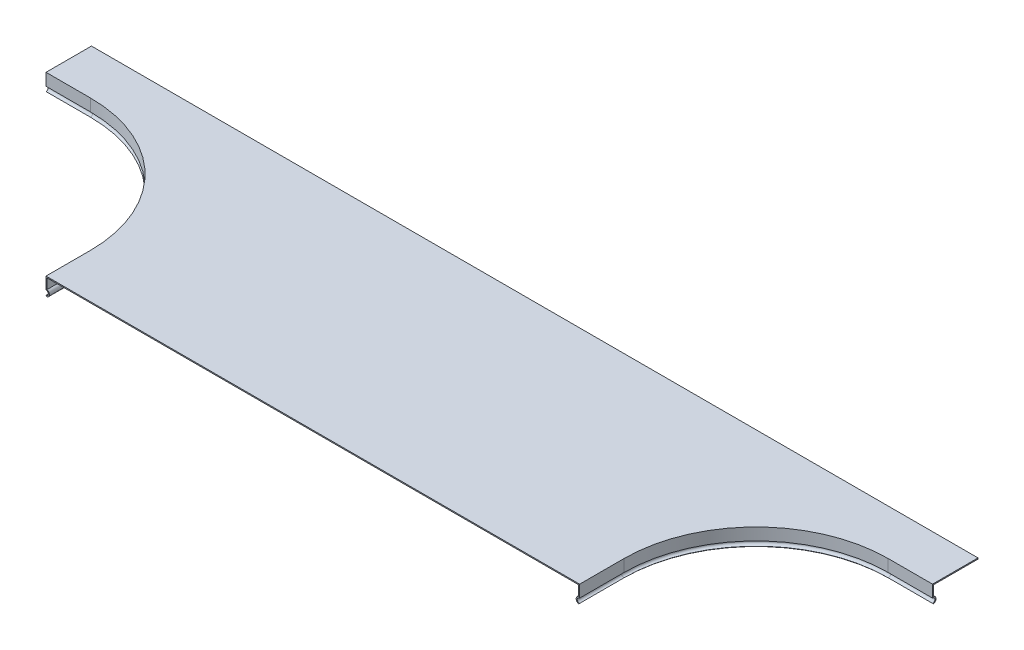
ISO-10303-21;
HEADER;
FILE_DESCRIPTION(('STEP AP214'),'2;1');
FILE_NAME('part.step','',(''),(''),'','','');
FILE_SCHEMA(('AUTOMOTIVE_DESIGN { 1 0 10303 214 1 1 1 1 }'));
ENDSEC;
DATA;
#1=APPLICATION_CONTEXT('core data for automotive mechanical design processes');
#2=APPLICATION_PROTOCOL_DEFINITION('international standard','automotive_design',2000,#1);
#3=PRODUCT_CONTEXT('',#1,'mechanical');
#4=PRODUCT('Part','Part','',(#3));
#5=PRODUCT_RELATED_PRODUCT_CATEGORY('part','',(#4));
#6=PRODUCT_DEFINITION_FORMATION('','',#4);
#7=PRODUCT_DEFINITION_CONTEXT('part definition',#1,'design');
#8=PRODUCT_DEFINITION('design','',#6,#7);
#9=PRODUCT_DEFINITION_SHAPE('','',#8);
#10=(LENGTH_UNIT() NAMED_UNIT(*) SI_UNIT(.MILLI.,.METRE.));
#11=(NAMED_UNIT(*) PLANE_ANGLE_UNIT() SI_UNIT($,.RADIAN.));
#12=(NAMED_UNIT(*) SI_UNIT($,.STERADIAN.) SOLID_ANGLE_UNIT());
#13=UNCERTAINTY_MEASURE_WITH_UNIT(LENGTH_MEASURE(1.E-05),#10,'distance_accuracy_value','');
#14=(GEOMETRIC_REPRESENTATION_CONTEXT(3) GLOBAL_UNCERTAINTY_ASSIGNED_CONTEXT((#13)) GLOBAL_UNIT_ASSIGNED_CONTEXT((#10,
#11,#12)) REPRESENTATION_CONTEXT('',''));
#15=CARTESIAN_POINT('',(0.,0.,0.));
#16=DIRECTION('',(0.,0.,1.));
#17=DIRECTION('',(1.,0.,0.));
#18=AXIS2_PLACEMENT_3D('',#15,#16,#17);
#19=CARTESIAN_POINT('',(0.,0.,-50.));
#20=DIRECTION('',(0.,-1.,0.));
#21=DIRECTION('',(1.,0.,0.));
#22=AXIS2_PLACEMENT_3D('',#19,#20,#21);
#23=PLANE('',#22);
#24=DIRECTION('',(0.,0.,-1.));
#25=VECTOR('',#24,1.);
#26=CARTESIAN_POINT('',(-798.786,0.,-200.));
#27=LINE('',#26,#25);
#28=CARTESIAN_POINT('',(-798.786,0.,-200.));
#29=VERTEX_POINT('',#28);
#30=CARTESIAN_POINT('',(-798.786,0.,-250.));
#31=VERTEX_POINT('',#30);
#32=EDGE_CURVE('E265',#29,#31,#27,.T.);
#33=ORIENTED_EDGE('',*,*,#32,.T.);
#34=DIRECTION('',(-1.,0.,0.));
#35=VECTOR('',#34,1.);
#36=CARTESIAN_POINT('',(-798.393,0.,-250.));
#37=LINE('',#36,#35);
#38=CARTESIAN_POINT('',(200.,0.,-250.));
#39=VERTEX_POINT('',#38);
#40=EDGE_CURVE('E53',#39,#31,#37,.T.);
#41=ORIENTED_EDGE('',*,*,#40,.F.);
#42=DIRECTION('',(0.,0.,1.));
#43=VECTOR('',#42,1.);
#44=CARTESIAN_POINT('',(200.,0.,-200.));
#45=LINE('',#44,#43);
#46=CARTESIAN_POINT('',(200.,0.,-200.));
#47=VERTEX_POINT('',#46);
#48=EDGE_CURVE('E373',#39,#47,#45,.T.);
#49=ORIENTED_EDGE('',*,*,#48,.T.);
#50=DIRECTION('',(1.,0.,0.));
#51=VECTOR('',#50,1.);
#52=CARTESIAN_POINT('',(150.,0.,-200.));
#53=LINE('',#52,#51);
#54=CARTESIAN_POINT('',(150.,0.,-200.));
#55=VERTEX_POINT('',#54);
#56=EDGE_CURVE('E389',#55,#47,#53,.T.);
#57=ORIENTED_EDGE('',*,*,#56,.F.);
#58=CARTESIAN_POINT('',(150.,0.,-50.));
#59=DIRECTION('',(0.,-1.,0.));
#60=DIRECTION('',(0.,0.,-1.));
#61=AXIS2_PLACEMENT_3D('',#58,#59,#60);
#62=CIRCLE('',#61,150.);
#63=CARTESIAN_POINT('',(0.,0.,-50.));
#64=VERTEX_POINT('',#63);
#65=EDGE_CURVE('E356',#64,#55,#62,.T.);
#66=ORIENTED_EDGE('',*,*,#65,.F.);
#67=DIRECTION('',(0.,0.,1.));
#68=VECTOR('',#67,1.);
#69=CARTESIAN_POINT('',(0.,0.,-50.));
#70=LINE('',#69,#68);
#71=CARTESIAN_POINT('',(0.,0.,0.));
#72=VERTEX_POINT('',#71);
#73=EDGE_CURVE('E312',#64,#72,#70,.T.);
#74=ORIENTED_EDGE('',*,*,#73,.T.);
#75=DIRECTION('',(1.,0.,0.));
#76=VECTOR('',#75,1.);
#77=CARTESIAN_POINT('',(0.,0.,0.));
#78=LINE('',#77,#76);
#79=CARTESIAN_POINT('',(-598.786,0.,0.));
#80=VERTEX_POINT('',#79);
#81=EDGE_CURVE('E295',#80,#72,#78,.T.);
#82=ORIENTED_EDGE('',*,*,#81,.F.);
#83=DIRECTION('',(0.,0.,1.));
#84=VECTOR('',#83,1.);
#85=CARTESIAN_POINT('',(-598.786,0.,-50.));
#86=LINE('',#85,#84);
#87=CARTESIAN_POINT('',(-598.786,0.,-50.));
#88=VERTEX_POINT('',#87);
#89=EDGE_CURVE('E242',#88,#80,#86,.T.);
#90=ORIENTED_EDGE('',*,*,#89,.F.);
#91=CARTESIAN_POINT('',(-748.786,0.,-50.));
#92=DIRECTION('',(0.,1.,0.));
#93=DIRECTION('',(0.,0.,1.));
#94=AXIS2_PLACEMENT_3D('',#91,#92,#93);
#95=CIRCLE('',#94,150.);
#96=CARTESIAN_POINT('',(-748.786,0.,-200.));
#97=VERTEX_POINT('',#96);
#98=EDGE_CURVE('E263',#88,#97,#95,.T.);
#99=ORIENTED_EDGE('',*,*,#98,.T.);
#100=DIRECTION('',(-1.,0.,0.));
#101=VECTOR('',#100,1.);
#102=CARTESIAN_POINT('',(-748.786,0.,-200.));
#103=LINE('',#102,#101);
#104=EDGE_CURVE('E293',#97,#29,#103,.T.);
#105=ORIENTED_EDGE('',*,*,#104,.T.);
#106=EDGE_LOOP('',(#33,#41,#49,#57,#66,#74,#82,#90,#99,#105));
#107=FACE_BOUND('',#106,.T.);
#108=ADVANCED_FACE('F30',(#107),#23,.T.);
#109=CARTESIAN_POINT('',(-298.786,1.21399999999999,-50.));
#110=DIRECTION('',(0.,1.,0.));
#111=DIRECTION('',(-1.,0.,0.));
#112=AXIS2_PLACEMENT_3D('',#109,#110,#111);
#113=PLANE('',#112);
#114=DIRECTION('',(-1.,0.,0.));
#115=VECTOR('',#114,1.);
#116=CARTESIAN_POINT('',(-798.393,1.21399999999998,-250.));
#117=LINE('',#116,#115);
#118=CARTESIAN_POINT('',(200.,1.214,-250.));
#119=VERTEX_POINT('',#118);
#120=CARTESIAN_POINT('',(-798.786,1.21399999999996,-250.));
#121=VERTEX_POINT('',#120);
#122=EDGE_CURVE('E45',#119,#121,#117,.T.);
#123=ORIENTED_EDGE('',*,*,#122,.T.);
#124=DIRECTION('',(0.,0.,1.));
#125=VECTOR('',#124,1.);
#126=CARTESIAN_POINT('',(-798.786,1.21399999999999,-500.));
#127=LINE('',#126,#125);
#128=CARTESIAN_POINT('',(-798.786,1.21399999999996,-198.786));
#129=VERTEX_POINT('',#128);
#130=EDGE_CURVE('E267',#121,#129,#127,.T.);
#131=ORIENTED_EDGE('',*,*,#130,.T.);
#132=DIRECTION('',(-1.,0.,0.));
#133=VECTOR('',#132,1.);
#134=CARTESIAN_POINT('',(-748.786,1.21399999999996,-198.786));
#135=LINE('',#134,#133);
#136=CARTESIAN_POINT('',(-748.786,1.21399999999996,-198.786));
#137=VERTEX_POINT('',#136);
#138=EDGE_CURVE('E211',#137,#129,#135,.T.);
#139=ORIENTED_EDGE('',*,*,#138,.F.);
#140=CARTESIAN_POINT('',(-748.786,1.21399999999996,-50.));
#141=DIRECTION('',(0.,1.,0.));
#142=DIRECTION('',(0.,0.,1.));
#143=AXIS2_PLACEMENT_3D('',#140,#141,#142);
#144=CIRCLE('',#143,148.786);
#145=CARTESIAN_POINT('',(-600.,1.21399999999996,-50.));
#146=VERTEX_POINT('',#145);
#147=EDGE_CURVE('E203',#146,#137,#144,.T.);
#148=ORIENTED_EDGE('',*,*,#147,.F.);
#149=DIRECTION('',(0.,0.,1.));
#150=VECTOR('',#149,1.);
#151=CARTESIAN_POINT('',(-600.,1.21399999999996,-50.));
#152=LINE('',#151,#150);
#153=CARTESIAN_POINT('',(-600.,1.21399999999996,0.));
#154=VERTEX_POINT('',#153);
#155=EDGE_CURVE('E208',#146,#154,#152,.T.);
#156=ORIENTED_EDGE('',*,*,#155,.T.);
#157=DIRECTION('',(-1.,0.,0.));
#158=VECTOR('',#157,1.);
#159=CARTESIAN_POINT('',(-298.786,1.21399999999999,0.));
#160=LINE('',#159,#158);
#161=CARTESIAN_POINT('',(1.214,1.214,0.));
#162=VERTEX_POINT('',#161);
#163=EDGE_CURVE('E300',#162,#154,#160,.T.);
#164=ORIENTED_EDGE('',*,*,#163,.F.);
#165=DIRECTION('',(0.,0.,1.));
#166=VECTOR('',#165,1.);
#167=CARTESIAN_POINT('',(1.214,1.214,-50.));
#168=LINE('',#167,#166);
#169=CARTESIAN_POINT('',(1.214,1.214,-50.));
#170=VERTEX_POINT('',#169);
#171=EDGE_CURVE('E331',#170,#162,#168,.T.);
#172=ORIENTED_EDGE('',*,*,#171,.F.);
#173=CARTESIAN_POINT('',(150.,1.214,-50.));
#174=DIRECTION('',(0.,-1.,0.));
#175=DIRECTION('',(0.,0.,-1.));
#176=AXIS2_PLACEMENT_3D('',#173,#174,#175);
#177=CIRCLE('',#176,148.786);
#178=CARTESIAN_POINT('',(150.,1.214,-198.786));
#179=VERTEX_POINT('',#178);
#180=EDGE_CURVE('E370',#170,#179,#177,.T.);
#181=ORIENTED_EDGE('',*,*,#180,.T.);
#182=DIRECTION('',(1.,0.,0.));
#183=VECTOR('',#182,1.);
#184=CARTESIAN_POINT('',(150.,1.214,-198.786));
#185=LINE('',#184,#183);
#186=CARTESIAN_POINT('',(200.,1.214,-198.786));
#187=VERTEX_POINT('',#186);
#188=EDGE_CURVE('E11',#179,#187,#185,.T.);
#189=ORIENTED_EDGE('',*,*,#188,.T.);
#190=DIRECTION('',(0.,0.,-1.));
#191=VECTOR('',#190,1.);
#192=CARTESIAN_POINT('',(200.,1.21399999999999,-498.786));
#193=LINE('',#192,#191);
#194=EDGE_CURVE('E386',#187,#119,#193,.T.);
#195=ORIENTED_EDGE('',*,*,#194,.T.);
#196=EDGE_LOOP('',(#123,#131,#139,#148,#156,#164,#172,#181,#189,#195));
#197=FACE_BOUND('',#196,.T.);
#198=ADVANCED_FACE('F205',(#197),#113,.T.);
#199=CARTESIAN_POINT('',(200.,-15.,-198.951208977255));
#200=DIRECTION('',(-1.,0.,0.));
#201=DIRECTION('',(0.,0.,1.));
#202=AXIS2_PLACEMENT_3D('',#199,#200,#201);
#203=PLANE('',#202);
#204=DIRECTION('',(0.,-1.,0.));
#205=VECTOR('',#204,1.);
#206=CARTESIAN_POINT('',(200.,1397.62053884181,-250.));
#207=LINE('',#206,#205);
#208=EDGE_CURVE('E413',#119,#39,#207,.T.);
#209=ORIENTED_EDGE('',*,*,#208,.F.);
#210=ORIENTED_EDGE('',*,*,#194,.F.);
#211=DIRECTION('',(0.,1.,0.));
#212=VECTOR('',#211,1.);
#213=CARTESIAN_POINT('',(200.,1.214,-198.786));
#214=LINE('',#213,#212);
#215=CARTESIAN_POINT('',(200.,-12.4333114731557,-198.786));
#216=VERTEX_POINT('',#215);
#217=EDGE_CURVE('E383',#216,#187,#214,.T.);
#218=ORIENTED_EDGE('',*,*,#217,.F.);
#219=CARTESIAN_POINT('',(200.,-15.,-198.951208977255));
#220=DIRECTION('',(1.,0.,0.));
#221=DIRECTION('',(0.,0.,1.));
#222=AXIS2_PLACEMENT_3D('',#219,#220,#221);
#223=CIRCLE('',#222,2.572);
#224=CARTESIAN_POINT('',(200.,-17.5666885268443,-198.786));
#225=VERTEX_POINT('',#224);
#226=EDGE_CURVE('E381',#225,#216,#223,.T.);
#227=ORIENTED_EDGE('',*,*,#226,.F.);
#228=DIRECTION('',(0.,0.707106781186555,0.707106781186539));
#229=VECTOR('',#228,1.);
#230=CARTESIAN_POINT('',(200.,-17.5666885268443,-198.786));
#231=LINE('',#230,#229);
#232=CARTESIAN_POINT('',(200.,-18.668356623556,-199.887668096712));
#233=VERTEX_POINT('',#232);
#234=EDGE_CURVE('E379',#233,#225,#231,.T.);
#235=ORIENTED_EDGE('',*,*,#234,.F.);
#236=CARTESIAN_POINT('',(200.,-15.,-198.951208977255));
#237=DIRECTION('',(-1.,0.,0.));
#238=DIRECTION('',(0.,0.,1.));
#239=AXIS2_PLACEMENT_3D('',#236,#237,#238);
#240=CIRCLE('',#239,3.786);
#241=CARTESIAN_POINT('',(200.,-11.3621663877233,-200.));
#242=VERTEX_POINT('',#241);
#243=EDGE_CURVE('E377',#242,#233,#240,.T.);
#244=ORIENTED_EDGE('',*,*,#243,.F.);
#245=DIRECTION('',(0.,-1.,0.));
#246=VECTOR('',#245,1.);
#247=CARTESIAN_POINT('',(200.,0.,-200.));
#248=LINE('',#247,#246);
#249=EDGE_CURVE('E375',#47,#242,#248,.T.);
#250=ORIENTED_EDGE('',*,*,#249,.F.);
#251=ORIENTED_EDGE('',*,*,#48,.F.);
#252=EDGE_LOOP('',(#209,#210,#218,#227,#235,#244,#250,#251));
#253=FACE_BOUND('',#252,.T.);
#254=ADVANCED_FACE('F412',(#253),#203,.F.);
#255=CARTESIAN_POINT('',(-798.786,-15.,-198.786));
#256=DIRECTION('',(-1.,0.,0.));
#257=DIRECTION('',(0.,0.,1.));
#258=AXIS2_PLACEMENT_3D('',#255,#256,#257);
#259=PLANE('',#258);
#260=ORIENTED_EDGE('',*,*,#130,.F.);
#261=DIRECTION('',(0.,-1.,0.));
#262=VECTOR('',#261,1.);
#263=CARTESIAN_POINT('',(-798.786,1397.62053884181,-250.));
#264=LINE('',#263,#262);
#265=EDGE_CURVE('E448',#121,#31,#264,.T.);
#266=ORIENTED_EDGE('',*,*,#265,.T.);
#267=ORIENTED_EDGE('',*,*,#32,.F.);
#268=DIRECTION('',(0.,1.,0.));
#269=VECTOR('',#268,1.);
#270=CARTESIAN_POINT('',(-798.786,0.,-200.));
#271=LINE('',#270,#269);
#272=CARTESIAN_POINT('',(-798.786,-11.4139157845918,-200.));
#273=VERTEX_POINT('',#272);
#274=EDGE_CURVE('E277',#273,#29,#271,.T.);
#275=ORIENTED_EDGE('',*,*,#274,.F.);
#276=CARTESIAN_POINT('',(-798.786,-15.,-198.786));
#277=DIRECTION('',(1.,0.,0.));
#278=DIRECTION('',(0.,0.,1.));
#279=AXIS2_PLACEMENT_3D('',#276,#277,#278);
#280=CIRCLE('',#279,3.786);
#281=CARTESIAN_POINT('',(-798.786,-18.6339995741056,-199.847999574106));
#282=VERTEX_POINT('',#281);
#283=EDGE_CURVE('E275',#282,#273,#280,.T.);
#284=ORIENTED_EDGE('',*,*,#283,.F.);
#285=DIRECTION('',(0.,-0.707106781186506,-0.707106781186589));
#286=VECTOR('',#285,1.);
#287=CARTESIAN_POINT('',(-798.786,-17.572,-198.786));
#288=LINE('',#287,#286);
#289=CARTESIAN_POINT('',(-798.786,-17.572,-198.786));
#290=VERTEX_POINT('',#289);
#291=EDGE_CURVE('E273',#290,#282,#288,.T.);
#292=ORIENTED_EDGE('',*,*,#291,.F.);
#293=CARTESIAN_POINT('',(-798.786,-15.,-198.786));
#294=DIRECTION('',(-1.,0.,0.));
#295=DIRECTION('',(0.,0.,1.));
#296=AXIS2_PLACEMENT_3D('',#293,#294,#295);
#297=CIRCLE('',#296,2.572);
#298=CARTESIAN_POINT('',(-798.786,-12.428,-198.786));
#299=VERTEX_POINT('',#298);
#300=EDGE_CURVE('E271',#299,#290,#297,.T.);
#301=ORIENTED_EDGE('',*,*,#300,.F.);
#302=DIRECTION('',(0.,-1.,0.));
#303=VECTOR('',#302,1.);
#304=CARTESIAN_POINT('',(-798.786,1.21399999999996,-198.786));
#305=LINE('',#304,#303);
#306=EDGE_CURVE('E269',#129,#299,#305,.T.);
#307=ORIENTED_EDGE('',*,*,#306,.F.);
#308=EDGE_LOOP('',(#260,#266,#267,#275,#284,#292,#301,#307));
#309=FACE_BOUND('',#308,.T.);
#310=ADVANCED_FACE('F529',(#309),#259,.T.);
#311=CARTESIAN_POINT('',(150.,1.214,-198.786));
#312=DIRECTION('',(0.,0.,-1.));
#313=DIRECTION('',(0.,1.,0.));
#314=AXIS2_PLACEMENT_3D('',#311,#312,#313);
#315=PLANE('',#314);
#316=ORIENTED_EDGE('',*,*,#217,.T.);
#317=ORIENTED_EDGE('',*,*,#188,.F.);
#318=DIRECTION('',(0.,1.,0.));
#319=VECTOR('',#318,1.);
#320=CARTESIAN_POINT('',(150.,1.214,-198.786));
#321=LINE('',#320,#319);
#322=CARTESIAN_POINT('',(150.,-12.4333114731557,-198.786));
#323=VERTEX_POINT('',#322);
#324=EDGE_CURVE('E354',#323,#179,#321,.T.);
#325=ORIENTED_EDGE('',*,*,#324,.F.);
#326=DIRECTION('',(1.,0.,0.));
#327=VECTOR('',#326,1.);
#328=CARTESIAN_POINT('',(150.,-12.4333114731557,-198.786));
#329=LINE('',#328,#327);
#330=EDGE_CURVE('E38',#323,#216,#329,.T.);
#331=ORIENTED_EDGE('',*,*,#330,.T.);
#332=EDGE_LOOP('',(#316,#317,#325,#331));
#333=FACE_BOUND('',#332,.T.);
#334=ADVANCED_FACE('F32',(#333),#315,.F.);
#335=CARTESIAN_POINT('',(150.,-15.,-198.951208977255));
#336=DIRECTION('',(1.,0.,0.));
#337=DIRECTION('',(0.,0.,-1.));
#338=AXIS2_PLACEMENT_3D('',#335,#336,#337);
#339=CYLINDRICAL_SURFACE('',#338,2.572);
#340=CARTESIAN_POINT('',(150.,-15.,-198.951208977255));
#341=DIRECTION('',(1.,0.,0.));
#342=DIRECTION('',(0.,0.,1.));
#343=AXIS2_PLACEMENT_3D('',#340,#341,#342);
#344=CIRCLE('',#343,2.572);
#345=CARTESIAN_POINT('',(150.,-17.5666885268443,-198.786));
#346=VERTEX_POINT('',#345);
#347=EDGE_CURVE('E351',#346,#323,#344,.T.);
#348=ORIENTED_EDGE('',*,*,#347,.F.);
#349=DIRECTION('',(1.,0.,0.));
#350=VECTOR('',#349,1.);
#351=CARTESIAN_POINT('',(150.,-17.5666885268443,-198.786));
#352=LINE('',#351,#350);
#353=EDGE_CURVE('E398',#346,#225,#352,.T.);
#354=ORIENTED_EDGE('',*,*,#353,.T.);
#355=ORIENTED_EDGE('',*,*,#226,.T.);
#356=ORIENTED_EDGE('',*,*,#330,.F.);
#357=EDGE_LOOP('',(#348,#354,#355,#356));
#358=FACE_BOUND('',#357,.T.);
#359=ADVANCED_FACE('F408',(#358),#339,.F.);
#360=CARTESIAN_POINT('',(150.,-17.5666885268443,-198.786));
#361=DIRECTION('',(0.,0.707106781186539,-0.707106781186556));
#362=DIRECTION('',(0.,0.707106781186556,0.707106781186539));
#363=AXIS2_PLACEMENT_3D('',#360,#361,#362);
#364=PLANE('',#363);
#365=DIRECTION('',(0.,0.707106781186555,0.707106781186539));
#366=VECTOR('',#365,1.);
#367=CARTESIAN_POINT('',(150.,-17.5666885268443,-198.786));
#368=LINE('',#367,#366);
#369=CARTESIAN_POINT('',(150.,-18.668356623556,-199.887668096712));
#370=VERTEX_POINT('',#369);
#371=EDGE_CURVE('E348',#370,#346,#368,.T.);
#372=ORIENTED_EDGE('',*,*,#371,.F.);
#373=DIRECTION('',(1.,0.,0.));
#374=VECTOR('',#373,1.);
#375=CARTESIAN_POINT('',(150.,-18.668356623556,-199.887668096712));
#376=LINE('',#375,#374);
#377=EDGE_CURVE('E395',#370,#233,#376,.T.);
#378=ORIENTED_EDGE('',*,*,#377,.T.);
#379=ORIENTED_EDGE('',*,*,#234,.T.);
#380=ORIENTED_EDGE('',*,*,#353,.F.);
#381=EDGE_LOOP('',(#372,#378,#379,#380));
#382=FACE_BOUND('',#381,.T.);
#383=ADVANCED_FACE('F430',(#382),#364,.F.);
#384=CARTESIAN_POINT('',(150.,-15.,-198.951208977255));
#385=DIRECTION('',(1.,0.,0.));
#386=DIRECTION('',(0.,0.,-1.));
#387=AXIS2_PLACEMENT_3D('',#384,#385,#386);
#388=CYLINDRICAL_SURFACE('',#387,3.786);
#389=CARTESIAN_POINT('',(150.,-15.,-198.951208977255));
#390=DIRECTION('',(-1.,0.,0.));
#391=DIRECTION('',(0.,0.,1.));
#392=AXIS2_PLACEMENT_3D('',#389,#390,#391);
#393=CIRCLE('',#392,3.786);
#394=CARTESIAN_POINT('',(150.,-11.3621663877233,-200.));
#395=VERTEX_POINT('',#394);
#396=EDGE_CURVE('E345',#395,#370,#393,.T.);
#397=ORIENTED_EDGE('',*,*,#396,.F.);
#398=DIRECTION('',(1.,0.,0.));
#399=VECTOR('',#398,1.);
#400=CARTESIAN_POINT('',(150.,-11.3621663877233,-200.));
#401=LINE('',#400,#399);
#402=EDGE_CURVE('E392',#395,#242,#401,.T.);
#403=ORIENTED_EDGE('',*,*,#402,.T.);
#404=ORIENTED_EDGE('',*,*,#243,.T.);
#405=ORIENTED_EDGE('',*,*,#377,.F.);
#406=EDGE_LOOP('',(#397,#403,#404,#405));
#407=FACE_BOUND('',#406,.T.);
#408=ADVANCED_FACE('F436',(#407),#388,.T.);
#409=CARTESIAN_POINT('',(150.,0.,-200.));
#410=DIRECTION('',(0.,0.,1.));
#411=DIRECTION('',(0.,-1.,0.));
#412=AXIS2_PLACEMENT_3D('',#409,#410,#411);
#413=PLANE('',#412);
#414=DIRECTION('',(0.,-1.,0.));
#415=VECTOR('',#414,1.);
#416=CARTESIAN_POINT('',(150.,0.,-200.));
#417=LINE('',#416,#415);
#418=EDGE_CURVE('E333',#55,#395,#417,.T.);
#419=ORIENTED_EDGE('',*,*,#418,.F.);
#420=ORIENTED_EDGE('',*,*,#56,.T.);
#421=ORIENTED_EDGE('',*,*,#249,.T.);
#422=ORIENTED_EDGE('',*,*,#402,.F.);
#423=EDGE_LOOP('',(#419,#420,#421,#422));
#424=FACE_BOUND('',#423,.T.);
#425=ADVANCED_FACE('F443',(#424),#413,.F.);
#426=CARTESIAN_POINT('',(150.,0.,-50.));
#427=DIRECTION('',(0.,-1.,0.));
#428=DIRECTION('',(0.,0.,-1.));
#429=AXIS2_PLACEMENT_3D('',#426,#427,#428);
#430=CYLINDRICAL_SURFACE('',#429,148.786);
#431=DIRECTION('',(0.,1.,0.));
#432=VECTOR('',#431,1.);
#433=CARTESIAN_POINT('',(1.214,1.214,-50.));
#434=LINE('',#433,#432);
#435=CARTESIAN_POINT('',(1.214,-12.4333114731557,-50.));
#436=VERTEX_POINT('',#435);
#437=EDGE_CURVE('E309',#436,#170,#434,.T.);
#438=ORIENTED_EDGE('',*,*,#437,.F.);
#439=CARTESIAN_POINT('',(150.,-12.4333114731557,-50.));
#440=DIRECTION('',(0.,-1.,0.));
#441=DIRECTION('',(0.,0.,-1.));
#442=AXIS2_PLACEMENT_3D('',#439,#440,#441);
#443=CIRCLE('',#442,148.786);
#444=EDGE_CURVE('E367',#436,#323,#443,.T.);
#445=ORIENTED_EDGE('',*,*,#444,.T.);
#446=ORIENTED_EDGE('',*,*,#324,.T.);
#447=ORIENTED_EDGE('',*,*,#180,.F.);
#448=EDGE_LOOP('',(#438,#445,#446,#447));
#449=FACE_BOUND('',#448,.T.);
#450=ADVANCED_FACE('F418',(#449),#430,.F.);
#451=CARTESIAN_POINT('',(150.,-15.,-50.));
#452=DIRECTION('',(0.,-1.,0.));
#453=DIRECTION('',(0.,0.,-1.));
#454=AXIS2_PLACEMENT_3D('',#451,#452,#453);
#455=TOROIDAL_SURFACE('',#454,148.951208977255,2.572);
#456=CARTESIAN_POINT('',(1.04879102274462,-15.,-50.));
#457=DIRECTION('',(0.,0.,-1.));
#458=DIRECTION('',(1.,0.,0.));
#459=AXIS2_PLACEMENT_3D('',#456,#457,#458);
#460=CIRCLE('',#459,2.572);
#461=CARTESIAN_POINT('',(1.214,-17.5666885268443,-50.));
#462=VERTEX_POINT('',#461);
#463=EDGE_CURVE('E306',#462,#436,#460,.T.);
#464=ORIENTED_EDGE('',*,*,#463,.F.);
#465=CARTESIAN_POINT('',(150.,-17.5666885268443,-50.));
#466=DIRECTION('',(0.,-1.,0.));
#467=DIRECTION('',(0.,0.,-1.));
#468=AXIS2_PLACEMENT_3D('',#465,#466,#467);
#469=CIRCLE('',#468,148.786);
#470=EDGE_CURVE('E364',#462,#346,#469,.T.);
#471=ORIENTED_EDGE('',*,*,#470,.T.);
#472=ORIENTED_EDGE('',*,*,#347,.T.);
#473=ORIENTED_EDGE('',*,*,#444,.F.);
#474=EDGE_LOOP('',(#464,#471,#472,#473));
#475=FACE_BOUND('',#474,.T.);
#476=ADVANCED_FACE('F422',(#475),#455,.F.);
#477=CARTESIAN_POINT('',(150.,-18.668356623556,-50.));
#478=DIRECTION('',(0.,-1.,0.));
#479=DIRECTION('',(0.,0.,-1.));
#480=AXIS2_PLACEMENT_3D('',#477,#478,#479);
#481=CONICAL_SURFACE('',#480,149.887668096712,0.785398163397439);
#482=DIRECTION('',(0.707106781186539,0.707106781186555,0.));
#483=VECTOR('',#482,1.);
#484=CARTESIAN_POINT('',(1.214,-17.5666885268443,-50.));
#485=LINE('',#484,#483);
#486=CARTESIAN_POINT('',(0.112331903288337,-18.668356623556,-50.));
#487=VERTEX_POINT('',#486);
#488=EDGE_CURVE('E303',#487,#462,#485,.T.);
#489=ORIENTED_EDGE('',*,*,#488,.F.);
#490=CARTESIAN_POINT('',(150.,-18.668356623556,-50.));
#491=DIRECTION('',(0.,-1.,0.));
#492=DIRECTION('',(0.,0.,-1.));
#493=AXIS2_PLACEMENT_3D('',#490,#491,#492);
#494=CIRCLE('',#493,149.887668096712);
#495=EDGE_CURVE('E361',#487,#370,#494,.T.);
#496=ORIENTED_EDGE('',*,*,#495,.T.);
#497=ORIENTED_EDGE('',*,*,#371,.T.);
#498=ORIENTED_EDGE('',*,*,#470,.F.);
#499=EDGE_LOOP('',(#489,#496,#497,#498));
#500=FACE_BOUND('',#499,.T.);
#501=ADVANCED_FACE('F426',(#500),#481,.F.);
#502=CARTESIAN_POINT('',(150.,-15.,-50.));
#503=DIRECTION('',(0.,-1.,0.));
#504=DIRECTION('',(0.,0.,-1.));
#505=AXIS2_PLACEMENT_3D('',#502,#503,#504);
#506=TOROIDAL_SURFACE('',#505,148.951208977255,3.786);
#507=CARTESIAN_POINT('',(1.04879102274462,-15.,-50.));
#508=DIRECTION('',(0.,0.,1.));
#509=DIRECTION('',(1.,0.,0.));
#510=AXIS2_PLACEMENT_3D('',#507,#508,#509);
#511=CIRCLE('',#510,3.786);
#512=CARTESIAN_POINT('',(0.,-11.3621663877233,-50.));
#513=VERTEX_POINT('',#512);
#514=EDGE_CURVE('E299',#513,#487,#511,.T.);
#515=ORIENTED_EDGE('',*,*,#514,.F.);
#516=CARTESIAN_POINT('',(150.,-11.3621663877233,-50.));
#517=DIRECTION('',(0.,-1.,0.));
#518=DIRECTION('',(0.,0.,-1.));
#519=AXIS2_PLACEMENT_3D('',#516,#517,#518);
#520=CIRCLE('',#519,150.);
#521=EDGE_CURVE('E358',#513,#395,#520,.T.);
#522=ORIENTED_EDGE('',*,*,#521,.T.);
#523=ORIENTED_EDGE('',*,*,#396,.T.);
#524=ORIENTED_EDGE('',*,*,#495,.F.);
#525=EDGE_LOOP('',(#515,#522,#523,#524));
#526=FACE_BOUND('',#525,.T.);
#527=ADVANCED_FACE('F434',(#526),#506,.T.);
#528=CARTESIAN_POINT('',(150.,0.,-50.));
#529=DIRECTION('',(0.,-1.,0.));
#530=DIRECTION('',(0.,0.,-1.));
#531=AXIS2_PLACEMENT_3D('',#528,#529,#530);
#532=CYLINDRICAL_SURFACE('',#531,150.);
#533=DIRECTION('',(0.,-1.,0.));
#534=VECTOR('',#533,1.);
#535=CARTESIAN_POINT('',(0.,0.,-50.));
#536=LINE('',#535,#534);
#537=EDGE_CURVE('E296',#64,#513,#536,.T.);
#538=ORIENTED_EDGE('',*,*,#537,.F.);
#539=ORIENTED_EDGE('',*,*,#65,.T.);
#540=ORIENTED_EDGE('',*,*,#418,.T.);
#541=ORIENTED_EDGE('',*,*,#521,.F.);
#542=EDGE_LOOP('',(#538,#539,#540,#541));
#543=FACE_BOUND('',#542,.T.);
#544=ADVANCED_FACE('F440',(#543),#532,.T.);
#545=CARTESIAN_POINT('',(1.214,1.214,-50.));
#546=DIRECTION('',(1.,0.,0.));
#547=DIRECTION('',(0.,1.,0.));
#548=AXIS2_PLACEMENT_3D('',#545,#546,#547);
#549=PLANE('',#548);
#550=DIRECTION('',(0.,1.,0.));
#551=VECTOR('',#550,1.);
#552=CARTESIAN_POINT('',(1.214,1.214,0.));
#553=LINE('',#552,#551);
#554=CARTESIAN_POINT('',(1.214,-12.4333114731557,0.));
#555=VERTEX_POINT('',#554);
#556=EDGE_CURVE('E327',#555,#162,#553,.T.);
#557=ORIENTED_EDGE('',*,*,#556,.F.);
#558=DIRECTION('',(0.,0.,1.));
#559=VECTOR('',#558,1.);
#560=CARTESIAN_POINT('',(1.214,-12.4333114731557,-50.));
#561=LINE('',#560,#559);
#562=EDGE_CURVE('E334',#436,#555,#561,.T.);
#563=ORIENTED_EDGE('',*,*,#562,.F.);
#564=ORIENTED_EDGE('',*,*,#437,.T.);
#565=ORIENTED_EDGE('',*,*,#171,.T.);
#566=EDGE_LOOP('',(#557,#563,#564,#565));
#567=FACE_BOUND('',#566,.T.);
#568=ADVANCED_FACE('F493',(#567),#549,.T.);
#569=CARTESIAN_POINT('',(1.04879102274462,-15.,-50.));
#570=DIRECTION('',(0.,0.,1.));
#571=DIRECTION('',(1.,0.,0.));
#572=AXIS2_PLACEMENT_3D('',#569,#570,#571);
#573=CYLINDRICAL_SURFACE('',#572,2.572);
#574=CARTESIAN_POINT('',(1.04879102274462,-15.,0.));
#575=DIRECTION('',(0.,0.,-1.));
#576=DIRECTION('',(1.,0.,0.));
#577=AXIS2_PLACEMENT_3D('',#574,#575,#576);
#578=CIRCLE('',#577,2.572);
#579=CARTESIAN_POINT('',(1.214,-17.5666885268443,0.));
#580=VERTEX_POINT('',#579);
#581=EDGE_CURVE('E324',#580,#555,#578,.T.);
#582=ORIENTED_EDGE('',*,*,#581,.F.);
#583=DIRECTION('',(0.,0.,1.));
#584=VECTOR('',#583,1.);
#585=CARTESIAN_POINT('',(1.214,-17.5666885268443,-50.));
#586=LINE('',#585,#584);
#587=EDGE_CURVE('E336',#462,#580,#586,.T.);
#588=ORIENTED_EDGE('',*,*,#587,.F.);
#589=ORIENTED_EDGE('',*,*,#463,.T.);
#590=ORIENTED_EDGE('',*,*,#562,.T.);
#591=EDGE_LOOP('',(#582,#588,#589,#590));
#592=FACE_BOUND('',#591,.T.);
#593=ADVANCED_FACE('F495',(#592),#573,.F.);
#594=CARTESIAN_POINT('',(1.214,-17.5666885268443,-50.));
#595=DIRECTION('',(0.707106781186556,-0.707106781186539,0.));
#596=DIRECTION('',(0.707106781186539,0.707106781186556,0.));
#597=AXIS2_PLACEMENT_3D('',#594,#595,#596);
#598=PLANE('',#597);
#599=DIRECTION('',(0.707106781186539,0.707106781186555,0.));
#600=VECTOR('',#599,1.);
#601=CARTESIAN_POINT('',(1.214,-17.5666885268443,0.));
#602=LINE('',#601,#600);
#603=CARTESIAN_POINT('',(0.112331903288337,-18.668356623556,0.));
#604=VERTEX_POINT('',#603);
#605=EDGE_CURVE('E321',#604,#580,#602,.T.);
#606=ORIENTED_EDGE('',*,*,#605,.F.);
#607=DIRECTION('',(0.,0.,1.));
#608=VECTOR('',#607,1.);
#609=CARTESIAN_POINT('',(0.112331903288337,-18.668356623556,-50.));
#610=LINE('',#609,#608);
#611=EDGE_CURVE('E338',#487,#604,#610,.T.);
#612=ORIENTED_EDGE('',*,*,#611,.F.);
#613=ORIENTED_EDGE('',*,*,#488,.T.);
#614=ORIENTED_EDGE('',*,*,#587,.T.);
#615=EDGE_LOOP('',(#606,#612,#613,#614));
#616=FACE_BOUND('',#615,.T.);
#617=ADVANCED_FACE('F498',(#616),#598,.T.);
#618=CARTESIAN_POINT('',(1.04879102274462,-15.,-50.));
#619=DIRECTION('',(0.,0.,1.));
#620=DIRECTION('',(1.,0.,0.));
#621=AXIS2_PLACEMENT_3D('',#618,#619,#620);
#622=CYLINDRICAL_SURFACE('',#621,3.786);
#623=CARTESIAN_POINT('',(1.04879102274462,-15.,0.));
#624=DIRECTION('',(0.,0.,1.));
#625=DIRECTION('',(1.,0.,0.));
#626=AXIS2_PLACEMENT_3D('',#623,#624,#625);
#627=CIRCLE('',#626,3.786);
#628=CARTESIAN_POINT('',(0.,-11.3621663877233,0.));
#629=VERTEX_POINT('',#628);
#630=EDGE_CURVE('E318',#629,#604,#627,.T.);
#631=ORIENTED_EDGE('',*,*,#630,.F.);
#632=DIRECTION('',(0.,0.,1.));
#633=VECTOR('',#632,1.);
#634=CARTESIAN_POINT('',(0.,-11.3621663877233,-50.));
#635=LINE('',#634,#633);
#636=EDGE_CURVE('E340',#513,#629,#635,.T.);
#637=ORIENTED_EDGE('',*,*,#636,.F.);
#638=ORIENTED_EDGE('',*,*,#514,.T.);
#639=ORIENTED_EDGE('',*,*,#611,.T.);
#640=EDGE_LOOP('',(#631,#637,#638,#639));
#641=FACE_BOUND('',#640,.T.);
#642=ADVANCED_FACE('F502',(#641),#622,.T.);
#643=CARTESIAN_POINT('',(0.,0.,-50.));
#644=DIRECTION('',(-1.,0.,0.));
#645=DIRECTION('',(0.,-1.,0.));
#646=AXIS2_PLACEMENT_3D('',#643,#644,#645);
#647=PLANE('',#646);
#648=DIRECTION('',(0.,-1.,0.));
#649=VECTOR('',#648,1.);
#650=CARTESIAN_POINT('',(0.,0.,0.));
#651=LINE('',#650,#649);
#652=EDGE_CURVE('E315',#72,#629,#651,.T.);
#653=ORIENTED_EDGE('',*,*,#652,.F.);
#654=ORIENTED_EDGE('',*,*,#73,.F.);
#655=ORIENTED_EDGE('',*,*,#537,.T.);
#656=ORIENTED_EDGE('',*,*,#636,.T.);
#657=EDGE_LOOP('',(#653,#654,#655,#656));
#658=FACE_BOUND('',#657,.T.);
#659=ADVANCED_FACE('F506',(#658),#647,.T.);
#660=CARTESIAN_POINT('',(1.04879102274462,-15.,0.));
#661=DIRECTION('',(0.,0.,1.));
#662=DIRECTION('',(1.,0.,0.));
#663=AXIS2_PLACEMENT_3D('',#660,#661,#662);
#664=PLANE('',#663);
#665=ORIENTED_EDGE('',*,*,#81,.T.);
#666=ORIENTED_EDGE('',*,*,#652,.T.);
#667=ORIENTED_EDGE('',*,*,#630,.T.);
#668=ORIENTED_EDGE('',*,*,#605,.T.);
#669=ORIENTED_EDGE('',*,*,#581,.T.);
#670=ORIENTED_EDGE('',*,*,#556,.T.);
#671=ORIENTED_EDGE('',*,*,#163,.T.);
#672=DIRECTION('',(0.,-1.,0.));
#673=VECTOR('',#672,1.);
#674=CARTESIAN_POINT('',(-600.,1.21399999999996,0.));
#675=LINE('',#674,#673);
#676=CARTESIAN_POINT('',(-600.,-12.428,0.));
#677=VERTEX_POINT('',#676);
#678=EDGE_CURVE('E228',#154,#677,#675,.T.);
#679=ORIENTED_EDGE('',*,*,#678,.T.);
#680=CARTESIAN_POINT('',(-600.,-15.,0.));
#681=DIRECTION('',(0.,0.,-1.));
#682=DIRECTION('',(-1.,0.,0.));
#683=AXIS2_PLACEMENT_3D('',#680,#681,#682);
#684=CIRCLE('',#683,2.572);
#685=CARTESIAN_POINT('',(-600.,-17.572,0.));
#686=VERTEX_POINT('',#685);
#687=EDGE_CURVE('E462',#677,#686,#684,.T.);
#688=ORIENTED_EDGE('',*,*,#687,.T.);
#689=DIRECTION('',(0.707106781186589,-0.707106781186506,0.));
#690=VECTOR('',#689,1.);
#691=CARTESIAN_POINT('',(-600.,-17.572,0.));
#692=LINE('',#691,#690);
#693=CARTESIAN_POINT('',(-598.938000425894,-18.6339995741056,0.));
#694=VERTEX_POINT('',#693);
#695=EDGE_CURVE('E465',#686,#694,#692,.T.);
#696=ORIENTED_EDGE('',*,*,#695,.T.);
#697=CARTESIAN_POINT('',(-600.,-15.,0.));
#698=DIRECTION('',(0.,0.,1.));
#699=DIRECTION('',(-1.,0.,0.));
#700=AXIS2_PLACEMENT_3D('',#697,#698,#699);
#701=CIRCLE('',#700,3.786);
#702=CARTESIAN_POINT('',(-598.786,-11.4139157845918,0.));
#703=VERTEX_POINT('',#702);
#704=EDGE_CURVE('E468',#694,#703,#701,.T.);
#705=ORIENTED_EDGE('',*,*,#704,.T.);
#706=DIRECTION('',(0.,1.,0.));
#707=VECTOR('',#706,1.);
#708=CARTESIAN_POINT('',(-598.786,0.,0.));
#709=LINE('',#708,#707);
#710=EDGE_CURVE('E224',#703,#80,#709,.T.);
#711=ORIENTED_EDGE('',*,*,#710,.T.);
#712=EDGE_LOOP('',(#665,#666,#667,#668,#669,#670,#671,#679,#688,#696,#705,#711));
#713=FACE_BOUND('',#712,.T.);
#714=ADVANCED_FACE('F489',(#713),#664,.T.);
#715=CARTESIAN_POINT('',(-748.786,0.,-200.));
#716=DIRECTION('',(0.,0.,1.));
#717=DIRECTION('',(1.,0.,0.));
#718=AXIS2_PLACEMENT_3D('',#715,#716,#717);
#719=PLANE('',#718);
#720=DIRECTION('',(0.,1.,0.));
#721=VECTOR('',#720,1.);
#722=CARTESIAN_POINT('',(-748.786,0.,-200.));
#723=LINE('',#722,#721);
#724=CARTESIAN_POINT('',(-748.786,-11.4139157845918,-200.));
#725=VERTEX_POINT('',#724);
#726=EDGE_CURVE('E215',#725,#97,#723,.T.);
#727=ORIENTED_EDGE('',*,*,#726,.F.);
#728=DIRECTION('',(-1.,0.,0.));
#729=VECTOR('',#728,1.);
#730=CARTESIAN_POINT('',(-748.786,-11.4139157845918,-200.));
#731=LINE('',#730,#729);
#732=EDGE_CURVE('E290',#725,#273,#731,.T.);
#733=ORIENTED_EDGE('',*,*,#732,.T.);
#734=ORIENTED_EDGE('',*,*,#274,.T.);
#735=ORIENTED_EDGE('',*,*,#104,.F.);
#736=EDGE_LOOP('',(#727,#733,#734,#735));
#737=FACE_BOUND('',#736,.T.);
#738=ADVANCED_FACE('F524',(#737),#719,.F.);
#739=CARTESIAN_POINT('',(-748.786,-15.,-198.786));
#740=DIRECTION('',(-1.,0.,0.));
#741=DIRECTION('',(0.,0.,1.));
#742=AXIS2_PLACEMENT_3D('',#739,#740,#741);
#743=CYLINDRICAL_SURFACE('',#742,3.786);
#744=CARTESIAN_POINT('',(-748.786,-15.,-198.786));
#745=DIRECTION('',(1.,0.,0.));
#746=DIRECTION('',(0.,0.,1.));
#747=AXIS2_PLACEMENT_3D('',#744,#745,#746);
#748=CIRCLE('',#747,3.786);
#749=CARTESIAN_POINT('',(-748.786,-18.6339995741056,-199.847999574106));
#750=VERTEX_POINT('',#749);
#751=EDGE_CURVE('E248',#750,#725,#748,.T.);
#752=ORIENTED_EDGE('',*,*,#751,.F.);
#753=DIRECTION('',(-1.,0.,0.));
#754=VECTOR('',#753,1.);
#755=CARTESIAN_POINT('',(-748.786,-18.6339995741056,-199.847999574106));
#756=LINE('',#755,#754);
#757=EDGE_CURVE('E287',#750,#282,#756,.T.);
#758=ORIENTED_EDGE('',*,*,#757,.T.);
#759=ORIENTED_EDGE('',*,*,#283,.T.);
#760=ORIENTED_EDGE('',*,*,#732,.F.);
#761=EDGE_LOOP('',(#752,#758,#759,#760));
#762=FACE_BOUND('',#761,.T.);
#763=ADVANCED_FACE('F548',(#762),#743,.T.);
#764=CARTESIAN_POINT('',(-748.786,-17.572,-198.786));
#765=DIRECTION('',(0.,0.707106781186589,-0.707106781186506));
#766=DIRECTION('',(0.,0.707106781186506,0.707106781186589));
#767=AXIS2_PLACEMENT_3D('',#764,#765,#766);
#768=PLANE('',#767);
#769=DIRECTION('',(0.,-0.707106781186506,-0.707106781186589));
#770=VECTOR('',#769,1.);
#771=CARTESIAN_POINT('',(-748.786,-17.572,-198.786));
#772=LINE('',#771,#770);
#773=CARTESIAN_POINT('',(-748.786,-17.572,-198.786));
#774=VERTEX_POINT('',#773);
#775=EDGE_CURVE('E245',#774,#750,#772,.T.);
#776=ORIENTED_EDGE('',*,*,#775,.F.);
#777=DIRECTION('',(-1.,0.,0.));
#778=VECTOR('',#777,1.);
#779=CARTESIAN_POINT('',(-748.786,-17.572,-198.786));
#780=LINE('',#779,#778);
#781=EDGE_CURVE('E284',#774,#290,#780,.T.);
#782=ORIENTED_EDGE('',*,*,#781,.T.);
#783=ORIENTED_EDGE('',*,*,#291,.T.);
#784=ORIENTED_EDGE('',*,*,#757,.F.);
#785=EDGE_LOOP('',(#776,#782,#783,#784));
#786=FACE_BOUND('',#785,.T.);
#787=ADVANCED_FACE('F545',(#786),#768,.F.);
#788=CARTESIAN_POINT('',(-748.786,-15.,-198.786));
#789=DIRECTION('',(-1.,0.,0.));
#790=DIRECTION('',(0.,0.,1.));
#791=AXIS2_PLACEMENT_3D('',#788,#789,#790);
#792=CYLINDRICAL_SURFACE('',#791,2.572);
#793=CARTESIAN_POINT('',(-748.786,-15.,-198.786));
#794=DIRECTION('',(-1.,0.,0.));
#795=DIRECTION('',(0.,0.,1.));
#796=AXIS2_PLACEMENT_3D('',#793,#794,#795);
#797=CIRCLE('',#796,2.572);
#798=CARTESIAN_POINT('',(-748.786,-12.428,-198.786));
#799=VERTEX_POINT('',#798);
#800=EDGE_CURVE('E241',#799,#774,#797,.T.);
#801=ORIENTED_EDGE('',*,*,#800,.F.);
#802=DIRECTION('',(-1.,0.,0.));
#803=VECTOR('',#802,1.);
#804=CARTESIAN_POINT('',(-748.786,-12.428,-198.786));
#805=LINE('',#804,#803);
#806=EDGE_CURVE('E281',#799,#299,#805,.T.);
#807=ORIENTED_EDGE('',*,*,#806,.T.);
#808=ORIENTED_EDGE('',*,*,#300,.T.);
#809=ORIENTED_EDGE('',*,*,#781,.F.);
#810=EDGE_LOOP('',(#801,#807,#808,#809));
#811=FACE_BOUND('',#810,.T.);
#812=ADVANCED_FACE('F537',(#811),#792,.F.);
#813=CARTESIAN_POINT('',(-748.786,1.21399999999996,-198.786));
#814=DIRECTION('',(0.,0.,-1.));
#815=DIRECTION('',(-1.,0.,0.));
#816=AXIS2_PLACEMENT_3D('',#813,#814,#815);
#817=PLANE('',#816);
#818=ORIENTED_EDGE('',*,*,#138,.T.);
#819=ORIENTED_EDGE('',*,*,#306,.T.);
#820=ORIENTED_EDGE('',*,*,#806,.F.);
#821=DIRECTION('',(0.,-1.,0.));
#822=VECTOR('',#821,1.);
#823=CARTESIAN_POINT('',(-748.786,1.21399999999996,-198.786));
#824=LINE('',#823,#822);
#825=EDGE_CURVE('E239',#137,#799,#824,.T.);
#826=ORIENTED_EDGE('',*,*,#825,.F.);
#827=EDGE_LOOP('',(#818,#819,#820,#826));
#828=FACE_BOUND('',#827,.T.);
#829=ADVANCED_FACE('F533',(#828),#817,.F.);
#830=CARTESIAN_POINT('',(-748.786,0.,-50.));
#831=DIRECTION('',(0.,1.,0.));
#832=DIRECTION('',(0.,0.,1.));
#833=AXIS2_PLACEMENT_3D('',#830,#831,#832);
#834=CYLINDRICAL_SURFACE('',#833,150.);
#835=DIRECTION('',(0.,1.,0.));
#836=VECTOR('',#835,1.);
#837=CARTESIAN_POINT('',(-598.786,0.,-50.));
#838=LINE('',#837,#836);
#839=CARTESIAN_POINT('',(-598.786,-11.4139157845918,-50.));
#840=VERTEX_POINT('',#839);
#841=EDGE_CURVE('E230',#840,#88,#838,.T.);
#842=ORIENTED_EDGE('',*,*,#841,.F.);
#843=CARTESIAN_POINT('',(-748.786,-11.4139157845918,-50.));
#844=DIRECTION('',(0.,1.,0.));
#845=DIRECTION('',(0.,0.,1.));
#846=AXIS2_PLACEMENT_3D('',#843,#844,#845);
#847=CIRCLE('',#846,150.);
#848=EDGE_CURVE('E260',#840,#725,#847,.T.);
#849=ORIENTED_EDGE('',*,*,#848,.T.);
#850=ORIENTED_EDGE('',*,*,#726,.T.);
#851=ORIENTED_EDGE('',*,*,#98,.F.);
#852=EDGE_LOOP('',(#842,#849,#850,#851));
#853=FACE_BOUND('',#852,.T.);
#854=ADVANCED_FACE('F520',(#853),#834,.T.);
#855=CARTESIAN_POINT('',(-748.786,-15.,-50.));
#856=DIRECTION('',(0.,1.,0.));
#857=DIRECTION('',(0.,0.,1.));
#858=AXIS2_PLACEMENT_3D('',#855,#856,#857);
#859=TOROIDAL_SURFACE('',#858,148.786,3.786);
#860=CARTESIAN_POINT('',(-600.,-15.,-50.));
#861=DIRECTION('',(0.,0.,1.));
#862=DIRECTION('',(-1.,0.,0.));
#863=AXIS2_PLACEMENT_3D('',#860,#861,#862);
#864=CIRCLE('',#863,3.786);
#865=CARTESIAN_POINT('',(-598.938000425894,-18.6339995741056,-50.));
#866=VERTEX_POINT('',#865);
#867=EDGE_CURVE('E235',#866,#840,#864,.T.);
#868=ORIENTED_EDGE('',*,*,#867,.F.);
#869=CARTESIAN_POINT('',(-748.786,-18.6339995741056,-50.));
#870=DIRECTION('',(0.,1.,0.));
#871=DIRECTION('',(0.,0.,1.));
#872=AXIS2_PLACEMENT_3D('',#869,#870,#871);
#873=CIRCLE('',#872,149.847999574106);
#874=EDGE_CURVE('E257',#866,#750,#873,.T.);
#875=ORIENTED_EDGE('',*,*,#874,.T.);
#876=ORIENTED_EDGE('',*,*,#751,.T.);
#877=ORIENTED_EDGE('',*,*,#848,.F.);
#878=EDGE_LOOP('',(#868,#875,#876,#877));
#879=FACE_BOUND('',#878,.T.);
#880=ADVANCED_FACE('F517',(#879),#859,.T.);
#881=CARTESIAN_POINT('',(-748.786,-17.572,-50.));
#882=DIRECTION('',(0.,-1.,0.));
#883=DIRECTION('',(0.,0.,-1.));
#884=AXIS2_PLACEMENT_3D('',#881,#882,#883);
#885=CONICAL_SURFACE('',#884,148.786,0.785398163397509);
#886=DIRECTION('',(0.707106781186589,-0.707106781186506,0.));
#887=VECTOR('',#886,1.);
#888=CARTESIAN_POINT('',(-600.,-17.572,-50.));
#889=LINE('',#888,#887);
#890=CARTESIAN_POINT('',(-600.,-17.572,-50.));
#891=VERTEX_POINT('',#890);
#892=EDGE_CURVE('E456',#891,#866,#889,.T.);
#893=ORIENTED_EDGE('',*,*,#892,.F.);
#894=CARTESIAN_POINT('',(-748.786,-17.572,-50.));
#895=DIRECTION('',(0.,1.,0.));
#896=DIRECTION('',(0.,0.,1.));
#897=AXIS2_PLACEMENT_3D('',#894,#895,#896);
#898=CIRCLE('',#897,148.786);
#899=EDGE_CURVE('E254',#891,#774,#898,.T.);
#900=ORIENTED_EDGE('',*,*,#899,.T.);
#901=ORIENTED_EDGE('',*,*,#775,.T.);
#902=ORIENTED_EDGE('',*,*,#874,.F.);
#903=EDGE_LOOP('',(#893,#900,#901,#902));
#904=FACE_BOUND('',#903,.T.);
#905=ADVANCED_FACE('F543',(#904),#885,.F.);
#906=CARTESIAN_POINT('',(-748.786,-15.,-50.));
#907=DIRECTION('',(0.,1.,0.));
#908=DIRECTION('',(0.,0.,1.));
#909=AXIS2_PLACEMENT_3D('',#906,#907,#908);
#910=TOROIDAL_SURFACE('',#909,148.786,2.572);
#911=CARTESIAN_POINT('',(-600.,-15.,-50.));
#912=DIRECTION('',(0.,0.,-1.));
#913=DIRECTION('',(-1.,0.,0.));
#914=AXIS2_PLACEMENT_3D('',#911,#912,#913);
#915=CIRCLE('',#914,2.572);
#916=CARTESIAN_POINT('',(-600.,-12.428,-50.));
#917=VERTEX_POINT('',#916);
#918=EDGE_CURVE('E223',#917,#891,#915,.T.);
#919=ORIENTED_EDGE('',*,*,#918,.F.);
#920=CARTESIAN_POINT('',(-748.786,-12.428,-50.));
#921=DIRECTION('',(0.,1.,0.));
#922=DIRECTION('',(0.,0.,1.));
#923=AXIS2_PLACEMENT_3D('',#920,#921,#922);
#924=CIRCLE('',#923,148.786);
#925=EDGE_CURVE('E214',#917,#799,#924,.T.);
#926=ORIENTED_EDGE('',*,*,#925,.T.);
#927=ORIENTED_EDGE('',*,*,#800,.T.);
#928=ORIENTED_EDGE('',*,*,#899,.F.);
#929=EDGE_LOOP('',(#919,#926,#927,#928));
#930=FACE_BOUND('',#929,.T.);
#931=ADVANCED_FACE('F540',(#930),#910,.F.);
#932=CARTESIAN_POINT('',(-748.786,0.,-50.));
#933=DIRECTION('',(0.,1.,0.));
#934=DIRECTION('',(0.,0.,1.));
#935=AXIS2_PLACEMENT_3D('',#932,#933,#934);
#936=CYLINDRICAL_SURFACE('',#935,148.786);
#937=DIRECTION('',(0.,-1.,0.));
#938=VECTOR('',#937,1.);
#939=CARTESIAN_POINT('',(-600.,1.21399999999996,-50.));
#940=LINE('',#939,#938);
#941=EDGE_CURVE('E218',#146,#917,#940,.T.);
#942=ORIENTED_EDGE('',*,*,#941,.F.);
#943=ORIENTED_EDGE('',*,*,#147,.T.);
#944=ORIENTED_EDGE('',*,*,#825,.T.);
#945=ORIENTED_EDGE('',*,*,#925,.F.);
#946=EDGE_LOOP('',(#942,#943,#944,#945));
#947=FACE_BOUND('',#946,.T.);
#948=ADVANCED_FACE('F219',(#947),#936,.F.);
#949=CARTESIAN_POINT('',(-598.786,0.,-50.));
#950=DIRECTION('',(1.,0.,0.));
#951=DIRECTION('',(0.,0.,-1.));
#952=AXIS2_PLACEMENT_3D('',#949,#950,#951);
#953=PLANE('',#952);
#954=ORIENTED_EDGE('',*,*,#710,.F.);
#955=DIRECTION('',(0.,0.,1.));
#956=VECTOR('',#955,1.);
#957=CARTESIAN_POINT('',(-598.786,-11.4139157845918,-50.));
#958=LINE('',#957,#956);
#959=EDGE_CURVE('E475',#840,#703,#958,.T.);
#960=ORIENTED_EDGE('',*,*,#959,.F.);
#961=ORIENTED_EDGE('',*,*,#841,.T.);
#962=ORIENTED_EDGE('',*,*,#89,.T.);
#963=EDGE_LOOP('',(#954,#960,#961,#962));
#964=FACE_BOUND('',#963,.T.);
#965=ADVANCED_FACE('F510',(#964),#953,.T.);
#966=CARTESIAN_POINT('',(-600.,-15.,-50.));
#967=DIRECTION('',(0.,0.,1.));
#968=DIRECTION('',(1.,0.,0.));
#969=AXIS2_PLACEMENT_3D('',#966,#967,#968);
#970=CYLINDRICAL_SURFACE('',#969,3.786);
#971=ORIENTED_EDGE('',*,*,#704,.F.);
#972=DIRECTION('',(0.,0.,1.));
#973=VECTOR('',#972,1.);
#974=CARTESIAN_POINT('',(-598.938000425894,-18.6339995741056,-50.));
#975=LINE('',#974,#973);
#976=EDGE_CURVE('E477',#866,#694,#975,.T.);
#977=ORIENTED_EDGE('',*,*,#976,.F.);
#978=ORIENTED_EDGE('',*,*,#867,.T.);
#979=ORIENTED_EDGE('',*,*,#959,.T.);
#980=EDGE_LOOP('',(#971,#977,#978,#979));
#981=FACE_BOUND('',#980,.T.);
#982=ADVANCED_FACE('F514',(#981),#970,.T.);
#983=CARTESIAN_POINT('',(-600.,-17.572,-50.));
#984=DIRECTION('',(-0.707106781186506,-0.707106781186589,0.));
#985=DIRECTION('',(0.707106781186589,-0.707106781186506,0.));
#986=AXIS2_PLACEMENT_3D('',#983,#984,#985);
#987=PLANE('',#986);
#988=ORIENTED_EDGE('',*,*,#695,.F.);
#989=DIRECTION('',(0.,0.,1.));
#990=VECTOR('',#989,1.);
#991=CARTESIAN_POINT('',(-600.,-17.572,-50.));
#992=LINE('',#991,#990);
#993=EDGE_CURVE('E232',#891,#686,#992,.T.);
#994=ORIENTED_EDGE('',*,*,#993,.F.);
#995=ORIENTED_EDGE('',*,*,#892,.T.);
#996=ORIENTED_EDGE('',*,*,#976,.T.);
#997=EDGE_LOOP('',(#988,#994,#995,#996));
#998=FACE_BOUND('',#997,.T.);
#999=ADVANCED_FACE('F485',(#998),#987,.T.);
#1000=CARTESIAN_POINT('',(-600.,-15.,-50.));
#1001=DIRECTION('',(0.,0.,1.));
#1002=DIRECTION('',(1.,0.,0.));
#1003=AXIS2_PLACEMENT_3D('',#1000,#1001,#1002);
#1004=CYLINDRICAL_SURFACE('',#1003,2.572);
#1005=ORIENTED_EDGE('',*,*,#687,.F.);
#1006=DIRECTION('',(0.,0.,1.));
#1007=VECTOR('',#1006,1.);
#1008=CARTESIAN_POINT('',(-600.,-12.428,-50.));
#1009=LINE('',#1008,#1007);
#1010=EDGE_CURVE('E229',#917,#677,#1009,.T.);
#1011=ORIENTED_EDGE('',*,*,#1010,.F.);
#1012=ORIENTED_EDGE('',*,*,#918,.T.);
#1013=ORIENTED_EDGE('',*,*,#993,.T.);
#1014=EDGE_LOOP('',(#1005,#1011,#1012,#1013));
#1015=FACE_BOUND('',#1014,.T.);
#1016=ADVANCED_FACE('F482',(#1015),#1004,.F.);
#1017=CARTESIAN_POINT('',(-600.,1.21399999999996,-50.));
#1018=DIRECTION('',(-1.,0.,0.));
#1019=DIRECTION('',(0.,0.,1.));
#1020=AXIS2_PLACEMENT_3D('',#1017,#1018,#1019);
#1021=PLANE('',#1020);
#1022=ORIENTED_EDGE('',*,*,#678,.F.);
#1023=ORIENTED_EDGE('',*,*,#155,.F.);
#1024=ORIENTED_EDGE('',*,*,#941,.T.);
#1025=ORIENTED_EDGE('',*,*,#1010,.T.);
#1026=EDGE_LOOP('',(#1022,#1023,#1024,#1025));
#1027=FACE_BOUND('',#1026,.T.);
#1028=ADVANCED_FACE('F226',(#1027),#1021,.T.);
#1029=CARTESIAN_POINT('',(-798.393,0.,-250.));
#1030=DIRECTION('',(0.,0.,-1.));
#1031=DIRECTION('',(-1.,0.,0.));
#1032=AXIS2_PLACEMENT_3D('',#1029,#1030,#1031);
#1033=PLANE('',#1032);
#1034=ORIENTED_EDGE('',*,*,#122,.F.);
#1035=ORIENTED_EDGE('',*,*,#208,.T.);
#1036=ORIENTED_EDGE('',*,*,#40,.T.);
#1037=ORIENTED_EDGE('',*,*,#265,.F.);
#1038=EDGE_LOOP('',(#1034,#1035,#1036,#1037));
#1039=FACE_BOUND('',#1038,.T.);
#1040=ADVANCED_FACE('F446',(#1039),#1033,.T.);
#1041=CLOSED_SHELL('',(#108,#198,#254,#310,#334,#359,#383,#408,#425,#450,#476,#501,#527,#544,
#568,#593,#617,#642,#659,#714,#738,#763,#787,#812,#829,#854,#880,#905,#931,#948,#965,#982,#999,
#1016,#1028,#1040));
#1042=MANIFOLD_SOLID_BREP('B2',#1041);
#1043=ADVANCED_BREP_SHAPE_REPRESENTATION('',(#18,#1042),#14);
#1044=SHAPE_DEFINITION_REPRESENTATION(#9,#1043);
ENDSEC;
END-ISO-10303-21;
